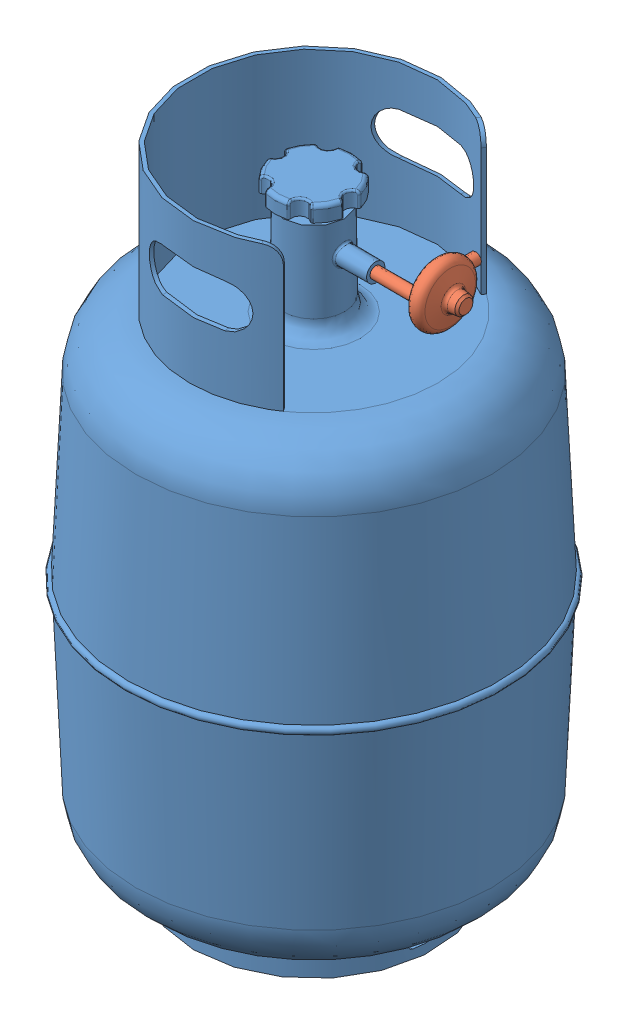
SolidWorks assembly Tank_&_Regulator_&.SLDASM, configuration Default (file format 12000). Lengths in mm.
Overall size (311.15 521.42 311.15).
2 component instances, 2 part files, 3 mates.
Components (placement in the parent):
- tank_20lb_propane_&-1: tank_20lb_propane_&.sldprt [Default] at origin size (311.15 521.42 311.15)
- regulator_&-1: regulator_&.sldprt [Default] at (86.675 431.8 -12.7) x (0 -1 0) z (0 0 1) size (50.8 73.97 63.5)
Mates (geometry in assembly coordinates):
- Concentric1: concentric: cylinder of tank_20lb_propane_&-1 through (50.8 431.8 0) axis (-1 0 0) radius 7.7; cylinder of regulator_&-1 through (38.1 431.8 0) axis (1 0 0) radius 3.9688
- Coincident1: coincident: plane of tank_20lb_propane_&-1 through (50.8 431.8 0) normal (1 0 0); circle of regulator_&-1
- Parallel1: parallel: plane of regulator_&-1; plane of assembly through (0 0 0) normal (0 1 0)
